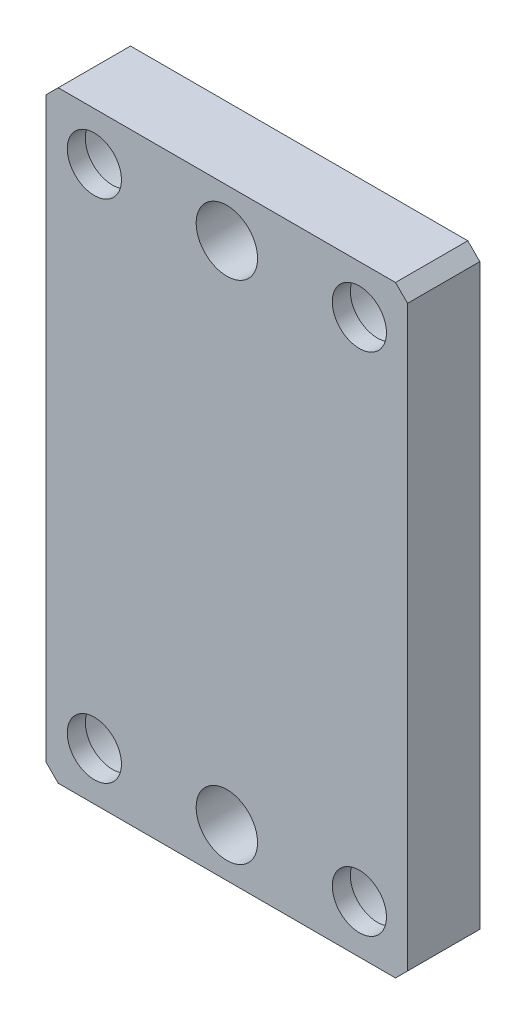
ISO-10303-21;
HEADER;
FILE_DESCRIPTION(('STEP AP214'),'2;1');
FILE_NAME('part.step','',(''),(''),'','','');
FILE_SCHEMA(('AUTOMOTIVE_DESIGN { 1 0 10303 214 1 1 1 1 }'));
ENDSEC;
DATA;
#1=APPLICATION_CONTEXT('core data for automotive mechanical design processes');
#2=APPLICATION_PROTOCOL_DEFINITION('international standard','automotive_design',2000,#1);
#3=PRODUCT_CONTEXT('',#1,'mechanical');
#4=PRODUCT('Part','Part','',(#3));
#5=PRODUCT_RELATED_PRODUCT_CATEGORY('part','',(#4));
#6=PRODUCT_DEFINITION_FORMATION('','',#4);
#7=PRODUCT_DEFINITION_CONTEXT('part definition',#1,'design');
#8=PRODUCT_DEFINITION('design','',#6,#7);
#9=PRODUCT_DEFINITION_SHAPE('','',#8);
#10=(LENGTH_UNIT() NAMED_UNIT(*) SI_UNIT(.MILLI.,.METRE.));
#11=(NAMED_UNIT(*) PLANE_ANGLE_UNIT() SI_UNIT($,.RADIAN.));
#12=(NAMED_UNIT(*) SI_UNIT($,.STERADIAN.) SOLID_ANGLE_UNIT());
#13=UNCERTAINTY_MEASURE_WITH_UNIT(LENGTH_MEASURE(1.E-05),#10,'distance_accuracy_value','');
#14=(GEOMETRIC_REPRESENTATION_CONTEXT(3) GLOBAL_UNCERTAINTY_ASSIGNED_CONTEXT((#13)) GLOBAL_UNIT_ASSIGNED_CONTEXT((#10,
#11,#12)) REPRESENTATION_CONTEXT('',''));
#15=CARTESIAN_POINT('',(0.,0.,0.));
#16=DIRECTION('',(0.,0.,1.));
#17=DIRECTION('',(1.,0.,0.));
#18=AXIS2_PLACEMENT_3D('',#15,#16,#17);
#19=CARTESIAN_POINT('',(30.,50.,12.));
#20=DIRECTION('',(-1.,0.,0.));
#21=DIRECTION('',(0.,-1.,0.));
#22=AXIS2_PLACEMENT_3D('',#19,#20,#21);
#23=PLANE('',#22);
#24=DIRECTION('',(0.,1.,0.));
#25=VECTOR('',#24,1.);
#26=CARTESIAN_POINT('',(30.,50.,0.));
#27=LINE('',#26,#25);
#28=CARTESIAN_POINT('',(30.,-48.,0.));
#29=VERTEX_POINT('',#28);
#30=CARTESIAN_POINT('',(30.,48.,0.));
#31=VERTEX_POINT('',#30);
#32=EDGE_CURVE('E140',#29,#31,#27,.T.);
#33=ORIENTED_EDGE('',*,*,#32,.T.);
#34=DIRECTION('',(0.,0.,1.));
#35=VECTOR('',#34,1.);
#36=CARTESIAN_POINT('',(30.,48.,12.));
#37=LINE('',#36,#35);
#38=CARTESIAN_POINT('',(30.,48.,12.));
#39=VERTEX_POINT('',#38);
#40=EDGE_CURVE('E11',#31,#39,#37,.T.);
#41=ORIENTED_EDGE('',*,*,#40,.T.);
#42=DIRECTION('',(0.,1.,0.));
#43=VECTOR('',#42,1.);
#44=CARTESIAN_POINT('',(30.,50.,12.));
#45=LINE('',#44,#43);
#46=CARTESIAN_POINT('',(30.,-48.,12.));
#47=VERTEX_POINT('',#46);
#48=EDGE_CURVE('E108',#47,#39,#45,.T.);
#49=ORIENTED_EDGE('',*,*,#48,.F.);
#50=DIRECTION('',(0.,0.,-1.));
#51=VECTOR('',#50,1.);
#52=CARTESIAN_POINT('',(30.,-48.,12.));
#53=LINE('',#52,#51);
#54=EDGE_CURVE('E24',#47,#29,#53,.T.);
#55=ORIENTED_EDGE('',*,*,#54,.T.);
#56=EDGE_LOOP('',(#33,#41,#49,#55));
#57=FACE_BOUND('',#56,.T.);
#58=ADVANCED_FACE('F16',(#57),#23,.F.);
#59=CARTESIAN_POINT('',(-30.,50.,12.));
#60=DIRECTION('',(0.,-1.,0.));
#61=DIRECTION('',(0.,0.,-1.));
#62=AXIS2_PLACEMENT_3D('',#59,#60,#61);
#63=PLANE('',#62);
#64=DIRECTION('',(-1.,0.,0.));
#65=VECTOR('',#64,1.);
#66=CARTESIAN_POINT('',(-30.,50.,0.));
#67=LINE('',#66,#65);
#68=CARTESIAN_POINT('',(28.,50.,0.));
#69=VERTEX_POINT('',#68);
#70=CARTESIAN_POINT('',(-28.,50.,0.));
#71=VERTEX_POINT('',#70);
#72=EDGE_CURVE('E113',#69,#71,#67,.T.);
#73=ORIENTED_EDGE('',*,*,#72,.T.);
#74=DIRECTION('',(0.,0.,1.));
#75=VECTOR('',#74,1.);
#76=CARTESIAN_POINT('',(-28.,50.,12.));
#77=LINE('',#76,#75);
#78=CARTESIAN_POINT('',(-28.,50.,12.));
#79=VERTEX_POINT('',#78);
#80=EDGE_CURVE('E31',#71,#79,#77,.T.);
#81=ORIENTED_EDGE('',*,*,#80,.T.);
#82=DIRECTION('',(-1.,0.,0.));
#83=VECTOR('',#82,1.);
#84=CARTESIAN_POINT('',(-30.,50.,12.));
#85=LINE('',#84,#83);
#86=CARTESIAN_POINT('',(28.,50.,12.));
#87=VERTEX_POINT('',#86);
#88=EDGE_CURVE('E111',#87,#79,#85,.T.);
#89=ORIENTED_EDGE('',*,*,#88,.F.);
#90=DIRECTION('',(0.,0.,-1.));
#91=VECTOR('',#90,1.);
#92=CARTESIAN_POINT('',(28.,50.,12.));
#93=LINE('',#92,#91);
#94=EDGE_CURVE('E132',#87,#69,#93,.T.);
#95=ORIENTED_EDGE('',*,*,#94,.T.);
#96=EDGE_LOOP('',(#73,#81,#89,#95));
#97=FACE_BOUND('',#96,.T.);
#98=ADVANCED_FACE('F245',(#97),#63,.F.);
#99=CARTESIAN_POINT('',(-30.,50.,12.));
#100=DIRECTION('',(1.,0.,0.));
#101=DIRECTION('',(0.,1.,0.));
#102=AXIS2_PLACEMENT_3D('',#99,#100,#101);
#103=PLANE('',#102);
#104=DIRECTION('',(0.,-1.,0.));
#105=VECTOR('',#104,1.);
#106=CARTESIAN_POINT('',(-30.,50.,0.));
#107=LINE('',#106,#105);
#108=CARTESIAN_POINT('',(-30.,48.,0.));
#109=VERTEX_POINT('',#108);
#110=CARTESIAN_POINT('',(-30.,-48.,0.));
#111=VERTEX_POINT('',#110);
#112=EDGE_CURVE('E109',#109,#111,#107,.T.);
#113=ORIENTED_EDGE('',*,*,#112,.T.);
#114=DIRECTION('',(0.,0.,1.));
#115=VECTOR('',#114,1.);
#116=CARTESIAN_POINT('',(-30.,-48.,12.));
#117=LINE('',#116,#115);
#118=CARTESIAN_POINT('',(-30.,-48.,12.));
#119=VERTEX_POINT('',#118);
#120=EDGE_CURVE('E87',#111,#119,#117,.T.);
#121=ORIENTED_EDGE('',*,*,#120,.T.);
#122=DIRECTION('',(0.,-1.,0.));
#123=VECTOR('',#122,1.);
#124=CARTESIAN_POINT('',(-30.,50.,12.));
#125=LINE('',#124,#123);
#126=CARTESIAN_POINT('',(-30.,48.,12.));
#127=VERTEX_POINT('',#126);
#128=EDGE_CURVE('E152',#127,#119,#125,.T.);
#129=ORIENTED_EDGE('',*,*,#128,.F.);
#130=DIRECTION('',(0.,0.,-1.));
#131=VECTOR('',#130,1.);
#132=CARTESIAN_POINT('',(-30.,48.,12.));
#133=LINE('',#132,#131);
#134=EDGE_CURVE('E92',#127,#109,#133,.T.);
#135=ORIENTED_EDGE('',*,*,#134,.T.);
#136=EDGE_LOOP('',(#113,#121,#129,#135));
#137=FACE_BOUND('',#136,.T.);
#138=ADVANCED_FACE('F251',(#137),#103,.F.);
#139=CARTESIAN_POINT('',(-30.,-50.,12.));
#140=DIRECTION('',(0.,1.,0.));
#141=DIRECTION('',(0.,0.,1.));
#142=AXIS2_PLACEMENT_3D('',#139,#140,#141);
#143=PLANE('',#142);
#144=DIRECTION('',(1.,0.,0.));
#145=VECTOR('',#144,1.);
#146=CARTESIAN_POINT('',(-30.,-50.,12.));
#147=LINE('',#146,#145);
#148=CARTESIAN_POINT('',(-28.,-50.,12.));
#149=VERTEX_POINT('',#148);
#150=CARTESIAN_POINT('',(28.,-50.,12.));
#151=VERTEX_POINT('',#150);
#152=EDGE_CURVE('E102',#149,#151,#147,.T.);
#153=ORIENTED_EDGE('',*,*,#152,.F.);
#154=DIRECTION('',(0.,0.,-1.));
#155=VECTOR('',#154,1.);
#156=CARTESIAN_POINT('',(-28.,-50.,12.));
#157=LINE('',#156,#155);
#158=CARTESIAN_POINT('',(-28.,-50.,0.));
#159=VERTEX_POINT('',#158);
#160=EDGE_CURVE('E86',#149,#159,#157,.T.);
#161=ORIENTED_EDGE('',*,*,#160,.T.);
#162=DIRECTION('',(1.,0.,0.));
#163=VECTOR('',#162,1.);
#164=CARTESIAN_POINT('',(-30.,-50.,0.));
#165=LINE('',#164,#163);
#166=CARTESIAN_POINT('',(28.,-50.,0.));
#167=VERTEX_POINT('',#166);
#168=EDGE_CURVE('E99',#159,#167,#165,.T.);
#169=ORIENTED_EDGE('',*,*,#168,.T.);
#170=DIRECTION('',(0.,0.,1.));
#171=VECTOR('',#170,1.);
#172=CARTESIAN_POINT('',(28.,-50.,12.));
#173=LINE('',#172,#171);
#174=EDGE_CURVE('E104',#167,#151,#173,.T.);
#175=ORIENTED_EDGE('',*,*,#174,.T.);
#176=EDGE_LOOP('',(#153,#161,#169,#175));
#177=FACE_BOUND('',#176,.T.);
#178=ADVANCED_FACE('F98',(#177),#143,.F.);
#179=CARTESIAN_POINT('',(0.,0.,12.));
#180=DIRECTION('',(0.,0.,1.));
#181=DIRECTION('',(1.,0.,0.));
#182=AXIS2_PLACEMENT_3D('',#179,#180,#181);
#183=PLANE('',#182);
#184=CARTESIAN_POINT('',(-22.,-42.,12.));
#185=DIRECTION('',(0.,0.,-1.));
#186=DIRECTION('',(-1.,0.,0.));
#187=AXIS2_PLACEMENT_3D('',#184,#185,#186);
#188=CIRCLE('',#187,4.5);
#189=CARTESIAN_POINT('',(-26.5,-42.,12.));
#190=VERTEX_POINT('',#189);
#191=EDGE_CURVE('E200',#190,#190,#188,.T.);
#192=ORIENTED_EDGE('',*,*,#191,.T.);
#193=EDGE_LOOP('',(#192));
#194=FACE_BOUND('',#193,.T.);
#195=CARTESIAN_POINT('',(22.,-42.,12.));
#196=DIRECTION('',(0.,0.,-1.));
#197=DIRECTION('',(-1.,0.,0.));
#198=AXIS2_PLACEMENT_3D('',#195,#196,#197);
#199=CIRCLE('',#198,4.5);
#200=CARTESIAN_POINT('',(17.5,-42.,12.));
#201=VERTEX_POINT('',#200);
#202=EDGE_CURVE('E188',#201,#201,#199,.T.);
#203=ORIENTED_EDGE('',*,*,#202,.T.);
#204=EDGE_LOOP('',(#203));
#205=FACE_BOUND('',#204,.T.);
#206=CARTESIAN_POINT('',(-22.,42.,12.));
#207=DIRECTION('',(0.,0.,-1.));
#208=DIRECTION('',(-1.,0.,0.));
#209=AXIS2_PLACEMENT_3D('',#206,#207,#208);
#210=CIRCLE('',#209,4.5);
#211=CARTESIAN_POINT('',(-26.5,42.,12.));
#212=VERTEX_POINT('',#211);
#213=EDGE_CURVE('E176',#212,#212,#210,.T.);
#214=ORIENTED_EDGE('',*,*,#213,.T.);
#215=EDGE_LOOP('',(#214));
#216=FACE_BOUND('',#215,.T.);
#217=CARTESIAN_POINT('',(22.,42.,12.));
#218=DIRECTION('',(0.,0.,-1.));
#219=DIRECTION('',(-1.,0.,0.));
#220=AXIS2_PLACEMENT_3D('',#217,#218,#219);
#221=CIRCLE('',#220,4.5);
#222=CARTESIAN_POINT('',(17.5,42.,12.));
#223=VERTEX_POINT('',#222);
#224=EDGE_CURVE('E164',#223,#223,#221,.T.);
#225=ORIENTED_EDGE('',*,*,#224,.T.);
#226=EDGE_LOOP('',(#225));
#227=FACE_BOUND('',#226,.T.);
#228=CARTESIAN_POINT('',(0.,-42.,12.));
#229=DIRECTION('',(0.,0.,-1.));
#230=DIRECTION('',(-1.,0.,0.));
#231=AXIS2_PLACEMENT_3D('',#228,#229,#230);
#232=CIRCLE('',#231,5.1);
#233=CARTESIAN_POINT('',(-5.10000000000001,-42.,12.));
#234=VERTEX_POINT('',#233);
#235=EDGE_CURVE('E158',#234,#234,#232,.T.);
#236=ORIENTED_EDGE('',*,*,#235,.T.);
#237=EDGE_LOOP('',(#236));
#238=FACE_BOUND('',#237,.T.);
#239=CARTESIAN_POINT('',(0.,42.,12.));
#240=DIRECTION('',(0.,0.,-1.));
#241=DIRECTION('',(-1.,0.,0.));
#242=AXIS2_PLACEMENT_3D('',#239,#240,#241);
#243=CIRCLE('',#242,5.1);
#244=CARTESIAN_POINT('',(-5.1,42.,12.));
#245=VERTEX_POINT('',#244);
#246=EDGE_CURVE('E145',#245,#245,#243,.T.);
#247=ORIENTED_EDGE('',*,*,#246,.T.);
#248=EDGE_LOOP('',(#247));
#249=FACE_BOUND('',#248,.T.);
#250=ORIENTED_EDGE('',*,*,#128,.T.);
#251=DIRECTION('',(-0.707106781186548,0.707106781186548,0.));
#252=VECTOR('',#251,1.);
#253=CARTESIAN_POINT('',(-39.,-39.,12.));
#254=LINE('',#253,#252);
#255=EDGE_CURVE('E130',#119,#149,#254,.F.);
#256=ORIENTED_EDGE('',*,*,#255,.T.);
#257=ORIENTED_EDGE('',*,*,#152,.T.);
#258=DIRECTION('',(-0.707106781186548,-0.707106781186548,0.));
#259=VECTOR('',#258,1.);
#260=CARTESIAN_POINT('',(39.,-39.,12.));
#261=LINE('',#260,#259);
#262=EDGE_CURVE('E125',#151,#47,#261,.F.);
#263=ORIENTED_EDGE('',*,*,#262,.T.);
#264=ORIENTED_EDGE('',*,*,#48,.T.);
#265=DIRECTION('',(0.707106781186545,-0.707106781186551,0.));
#266=VECTOR('',#265,1.);
#267=CARTESIAN_POINT('',(39.,39.,12.));
#268=LINE('',#267,#266);
#269=EDGE_CURVE('E38',#39,#87,#268,.F.);
#270=ORIENTED_EDGE('',*,*,#269,.T.);
#271=ORIENTED_EDGE('',*,*,#88,.T.);
#272=DIRECTION('',(0.707106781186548,0.707106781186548,0.));
#273=VECTOR('',#272,1.);
#274=CARTESIAN_POINT('',(-39.,39.,12.));
#275=LINE('',#274,#273);
#276=EDGE_CURVE('E128',#79,#127,#275,.F.);
#277=ORIENTED_EDGE('',*,*,#276,.T.);
#278=EDGE_LOOP('',(#250,#256,#257,#263,#264,#270,#271,#277));
#279=FACE_BOUND('',#278,.T.);
#280=ADVANCED_FACE('F218',(#194,#205,#216,#227,#238,#249,#279),#183,.T.);
#281=CARTESIAN_POINT('',(0.,0.,0.));
#282=DIRECTION('',(0.,0.,1.));
#283=DIRECTION('',(1.,0.,0.));
#284=AXIS2_PLACEMENT_3D('',#281,#282,#283);
#285=PLANE('',#284);
#286=CARTESIAN_POINT('',(-22.,-42.,0.));
#287=DIRECTION('',(0.,0.,-1.));
#288=DIRECTION('',(-1.,0.,0.));
#289=AXIS2_PLACEMENT_3D('',#286,#287,#288);
#290=CIRCLE('',#289,7.5);
#291=CARTESIAN_POINT('',(-29.5,-42.,0.));
#292=VERTEX_POINT('',#291);
#293=EDGE_CURVE('E209',#292,#292,#290,.T.);
#294=ORIENTED_EDGE('',*,*,#293,.F.);
#295=EDGE_LOOP('',(#294));
#296=FACE_BOUND('',#295,.T.);
#297=CARTESIAN_POINT('',(22.,-42.,0.));
#298=DIRECTION('',(0.,0.,-1.));
#299=DIRECTION('',(-1.,0.,0.));
#300=AXIS2_PLACEMENT_3D('',#297,#298,#299);
#301=CIRCLE('',#300,7.5);
#302=CARTESIAN_POINT('',(14.5,-42.,0.));
#303=VERTEX_POINT('',#302);
#304=EDGE_CURVE('E197',#303,#303,#301,.T.);
#305=ORIENTED_EDGE('',*,*,#304,.F.);
#306=EDGE_LOOP('',(#305));
#307=FACE_BOUND('',#306,.T.);
#308=CARTESIAN_POINT('',(-22.,42.,0.));
#309=DIRECTION('',(0.,0.,-1.));
#310=DIRECTION('',(-1.,0.,0.));
#311=AXIS2_PLACEMENT_3D('',#308,#309,#310);
#312=CIRCLE('',#311,7.5);
#313=CARTESIAN_POINT('',(-29.5,42.,0.));
#314=VERTEX_POINT('',#313);
#315=EDGE_CURVE('E185',#314,#314,#312,.T.);
#316=ORIENTED_EDGE('',*,*,#315,.F.);
#317=EDGE_LOOP('',(#316));
#318=FACE_BOUND('',#317,.T.);
#319=CARTESIAN_POINT('',(22.,42.,0.));
#320=DIRECTION('',(0.,0.,-1.));
#321=DIRECTION('',(-1.,0.,0.));
#322=AXIS2_PLACEMENT_3D('',#319,#320,#321);
#323=CIRCLE('',#322,7.5);
#324=CARTESIAN_POINT('',(14.5,42.,0.));
#325=VERTEX_POINT('',#324);
#326=EDGE_CURVE('E173',#325,#325,#323,.T.);
#327=ORIENTED_EDGE('',*,*,#326,.F.);
#328=EDGE_LOOP('',(#327));
#329=FACE_BOUND('',#328,.T.);
#330=CARTESIAN_POINT('',(0.,-42.,0.));
#331=DIRECTION('',(0.,0.,-1.));
#332=DIRECTION('',(-1.,0.,0.));
#333=AXIS2_PLACEMENT_3D('',#330,#331,#332);
#334=CIRCLE('',#333,5.1);
#335=CARTESIAN_POINT('',(-5.10000000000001,-42.,0.));
#336=VERTEX_POINT('',#335);
#337=EDGE_CURVE('E161',#336,#336,#334,.T.);
#338=ORIENTED_EDGE('',*,*,#337,.F.);
#339=EDGE_LOOP('',(#338));
#340=FACE_BOUND('',#339,.T.);
#341=CARTESIAN_POINT('',(0.,42.,0.));
#342=DIRECTION('',(0.,0.,-1.));
#343=DIRECTION('',(-1.,0.,0.));
#344=AXIS2_PLACEMENT_3D('',#341,#342,#343);
#345=CIRCLE('',#344,5.1);
#346=CARTESIAN_POINT('',(-5.1,42.,0.));
#347=VERTEX_POINT('',#346);
#348=EDGE_CURVE('E148',#347,#347,#345,.T.);
#349=ORIENTED_EDGE('',*,*,#348,.F.);
#350=EDGE_LOOP('',(#349));
#351=FACE_BOUND('',#350,.T.);
#352=ORIENTED_EDGE('',*,*,#168,.F.);
#353=DIRECTION('',(0.707106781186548,-0.707106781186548,0.));
#354=VECTOR('',#353,1.);
#355=CARTESIAN_POINT('',(-28.,-50.,0.));
#356=LINE('',#355,#354);
#357=EDGE_CURVE('E82',#159,#111,#356,.F.);
#358=ORIENTED_EDGE('',*,*,#357,.T.);
#359=ORIENTED_EDGE('',*,*,#112,.F.);
#360=DIRECTION('',(-0.707106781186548,-0.707106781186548,0.));
#361=VECTOR('',#360,1.);
#362=CARTESIAN_POINT('',(-30.,48.,0.));
#363=LINE('',#362,#361);
#364=EDGE_CURVE('E93',#109,#71,#363,.F.);
#365=ORIENTED_EDGE('',*,*,#364,.T.);
#366=ORIENTED_EDGE('',*,*,#72,.F.);
#367=DIRECTION('',(-0.707106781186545,0.707106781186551,0.));
#368=VECTOR('',#367,1.);
#369=CARTESIAN_POINT('',(28.,50.,0.));
#370=LINE('',#369,#368);
#371=EDGE_CURVE('E119',#69,#31,#370,.F.);
#372=ORIENTED_EDGE('',*,*,#371,.T.);
#373=ORIENTED_EDGE('',*,*,#32,.F.);
#374=DIRECTION('',(0.707106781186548,0.707106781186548,0.));
#375=VECTOR('',#374,1.);
#376=CARTESIAN_POINT('',(30.,-48.,0.));
#377=LINE('',#376,#375);
#378=EDGE_CURVE('E103',#29,#167,#377,.F.);
#379=ORIENTED_EDGE('',*,*,#378,.T.);
#380=EDGE_LOOP('',(#352,#358,#359,#365,#366,#372,#373,#379));
#381=FACE_BOUND('',#380,.T.);
#382=ADVANCED_FACE('F106',(#296,#307,#318,#329,#340,#351,#381),#285,.F.);
#383=CARTESIAN_POINT('',(0.,42.,0.));
#384=DIRECTION('',(0.,0.,-1.));
#385=DIRECTION('',(-1.,0.,0.));
#386=AXIS2_PLACEMENT_3D('',#383,#384,#385);
#387=CYLINDRICAL_SURFACE('',#386,5.1);
#388=ORIENTED_EDGE('',*,*,#246,.F.);
#389=EDGE_LOOP('',(#388));
#390=FACE_BOUND('',#389,.T.);
#391=ORIENTED_EDGE('',*,*,#348,.T.);
#392=EDGE_LOOP('',(#391));
#393=FACE_BOUND('',#392,.T.);
#394=ADVANCED_FACE('F217',(#390,#393),#387,.F.);
#395=CARTESIAN_POINT('',(0.,-42.,0.));
#396=DIRECTION('',(0.,0.,-1.));
#397=DIRECTION('',(-1.,0.,0.));
#398=AXIS2_PLACEMENT_3D('',#395,#396,#397);
#399=CYLINDRICAL_SURFACE('',#398,5.1);
#400=ORIENTED_EDGE('',*,*,#235,.F.);
#401=EDGE_LOOP('',(#400));
#402=FACE_BOUND('',#401,.T.);
#403=ORIENTED_EDGE('',*,*,#337,.T.);
#404=EDGE_LOOP('',(#403));
#405=FACE_BOUND('',#404,.T.);
#406=ADVANCED_FACE('F231',(#402,#405),#399,.F.);
#407=CARTESIAN_POINT('',(22.,42.,0.));
#408=DIRECTION('',(0.,0.,-1.));
#409=DIRECTION('',(-1.,0.,0.));
#410=AXIS2_PLACEMENT_3D('',#407,#408,#409);
#411=CYLINDRICAL_SURFACE('',#410,4.5);
#412=ORIENTED_EDGE('',*,*,#224,.F.);
#413=EDGE_LOOP('',(#412));
#414=FACE_BOUND('',#413,.T.);
#415=CARTESIAN_POINT('',(22.,42.,9.));
#416=DIRECTION('',(0.,0.,-1.));
#417=DIRECTION('',(-1.,0.,0.));
#418=AXIS2_PLACEMENT_3D('',#415,#416,#417);
#419=CIRCLE('',#418,4.5);
#420=CARTESIAN_POINT('',(17.5,42.,9.));
#421=VERTEX_POINT('',#420);
#422=EDGE_CURVE('E167',#421,#421,#419,.T.);
#423=ORIENTED_EDGE('',*,*,#422,.T.);
#424=EDGE_LOOP('',(#423));
#425=FACE_BOUND('',#424,.T.);
#426=ADVANCED_FACE('F239',(#414,#425),#411,.F.);
#427=CARTESIAN_POINT('',(26.5,42.,9.));
#428=DIRECTION('',(0.,0.,1.));
#429=DIRECTION('',(1.,0.,0.));
#430=AXIS2_PLACEMENT_3D('',#427,#428,#429);
#431=PLANE('',#430);
#432=ORIENTED_EDGE('',*,*,#422,.F.);
#433=EDGE_LOOP('',(#432));
#434=FACE_BOUND('',#433,.T.);
#435=CARTESIAN_POINT('',(22.,42.,9.));
#436=DIRECTION('',(0.,0.,-1.));
#437=DIRECTION('',(-1.,0.,0.));
#438=AXIS2_PLACEMENT_3D('',#435,#436,#437);
#439=CIRCLE('',#438,7.5);
#440=CARTESIAN_POINT('',(14.5,42.,9.));
#441=VERTEX_POINT('',#440);
#442=EDGE_CURVE('E170',#441,#441,#439,.T.);
#443=ORIENTED_EDGE('',*,*,#442,.T.);
#444=EDGE_LOOP('',(#443));
#445=FACE_BOUND('',#444,.T.);
#446=ADVANCED_FACE('F325',(#434,#445),#431,.F.);
#447=CARTESIAN_POINT('',(22.,42.,0.));
#448=DIRECTION('',(0.,0.,-1.));
#449=DIRECTION('',(-1.,0.,0.));
#450=AXIS2_PLACEMENT_3D('',#447,#448,#449);
#451=CYLINDRICAL_SURFACE('',#450,7.5);
#452=ORIENTED_EDGE('',*,*,#442,.F.);
#453=EDGE_LOOP('',(#452));
#454=FACE_BOUND('',#453,.T.);
#455=ORIENTED_EDGE('',*,*,#326,.T.);
#456=EDGE_LOOP('',(#455));
#457=FACE_BOUND('',#456,.T.);
#458=ADVANCED_FACE('F335',(#454,#457),#451,.F.);
#459=CARTESIAN_POINT('',(-22.,42.,0.));
#460=DIRECTION('',(0.,0.,-1.));
#461=DIRECTION('',(-1.,0.,0.));
#462=AXIS2_PLACEMENT_3D('',#459,#460,#461);
#463=CYLINDRICAL_SURFACE('',#462,4.5);
#464=ORIENTED_EDGE('',*,*,#213,.F.);
#465=EDGE_LOOP('',(#464));
#466=FACE_BOUND('',#465,.T.);
#467=CARTESIAN_POINT('',(-22.,42.,9.));
#468=DIRECTION('',(0.,0.,-1.));
#469=DIRECTION('',(-1.,0.,0.));
#470=AXIS2_PLACEMENT_3D('',#467,#468,#469);
#471=CIRCLE('',#470,4.5);
#472=CARTESIAN_POINT('',(-26.5,42.,9.));
#473=VERTEX_POINT('',#472);
#474=EDGE_CURVE('E179',#473,#473,#471,.T.);
#475=ORIENTED_EDGE('',*,*,#474,.T.);
#476=EDGE_LOOP('',(#475));
#477=FACE_BOUND('',#476,.T.);
#478=ADVANCED_FACE('F345',(#466,#477),#463,.F.);
#479=CARTESIAN_POINT('',(-17.5,42.,9.));
#480=DIRECTION('',(0.,0.,1.));
#481=DIRECTION('',(1.,0.,0.));
#482=AXIS2_PLACEMENT_3D('',#479,#480,#481);
#483=PLANE('',#482);
#484=ORIENTED_EDGE('',*,*,#474,.F.);
#485=EDGE_LOOP('',(#484));
#486=FACE_BOUND('',#485,.T.);
#487=CARTESIAN_POINT('',(-22.,42.,9.));
#488=DIRECTION('',(0.,0.,-1.));
#489=DIRECTION('',(-1.,0.,0.));
#490=AXIS2_PLACEMENT_3D('',#487,#488,#489);
#491=CIRCLE('',#490,7.5);
#492=CARTESIAN_POINT('',(-29.5,42.,9.));
#493=VERTEX_POINT('',#492);
#494=EDGE_CURVE('E182',#493,#493,#491,.T.);
#495=ORIENTED_EDGE('',*,*,#494,.T.);
#496=EDGE_LOOP('',(#495));
#497=FACE_BOUND('',#496,.T.);
#498=ADVANCED_FACE('F355',(#486,#497),#483,.F.);
#499=CARTESIAN_POINT('',(-22.,42.,0.));
#500=DIRECTION('',(0.,0.,-1.));
#501=DIRECTION('',(-1.,0.,0.));
#502=AXIS2_PLACEMENT_3D('',#499,#500,#501);
#503=CYLINDRICAL_SURFACE('',#502,7.5);
#504=ORIENTED_EDGE('',*,*,#494,.F.);
#505=EDGE_LOOP('',(#504));
#506=FACE_BOUND('',#505,.T.);
#507=ORIENTED_EDGE('',*,*,#315,.T.);
#508=EDGE_LOOP('',(#507));
#509=FACE_BOUND('',#508,.T.);
#510=ADVANCED_FACE('F365',(#506,#509),#503,.F.);
#511=CARTESIAN_POINT('',(22.,-42.,0.));
#512=DIRECTION('',(0.,0.,-1.));
#513=DIRECTION('',(-1.,0.,0.));
#514=AXIS2_PLACEMENT_3D('',#511,#512,#513);
#515=CYLINDRICAL_SURFACE('',#514,4.5);
#516=ORIENTED_EDGE('',*,*,#202,.F.);
#517=EDGE_LOOP('',(#516));
#518=FACE_BOUND('',#517,.T.);
#519=CARTESIAN_POINT('',(22.,-42.,9.));
#520=DIRECTION('',(0.,0.,-1.));
#521=DIRECTION('',(-1.,0.,0.));
#522=AXIS2_PLACEMENT_3D('',#519,#520,#521);
#523=CIRCLE('',#522,4.5);
#524=CARTESIAN_POINT('',(17.5,-42.,9.));
#525=VERTEX_POINT('',#524);
#526=EDGE_CURVE('E191',#525,#525,#523,.T.);
#527=ORIENTED_EDGE('',*,*,#526,.T.);
#528=EDGE_LOOP('',(#527));
#529=FACE_BOUND('',#528,.T.);
#530=ADVANCED_FACE('F375',(#518,#529),#515,.F.);
#531=CARTESIAN_POINT('',(26.5,-42.,9.));
#532=DIRECTION('',(0.,0.,1.));
#533=DIRECTION('',(1.,0.,0.));
#534=AXIS2_PLACEMENT_3D('',#531,#532,#533);
#535=PLANE('',#534);
#536=ORIENTED_EDGE('',*,*,#526,.F.);
#537=EDGE_LOOP('',(#536));
#538=FACE_BOUND('',#537,.T.);
#539=CARTESIAN_POINT('',(22.,-42.,9.));
#540=DIRECTION('',(0.,0.,-1.));
#541=DIRECTION('',(-1.,0.,0.));
#542=AXIS2_PLACEMENT_3D('',#539,#540,#541);
#543=CIRCLE('',#542,7.5);
#544=CARTESIAN_POINT('',(14.5,-42.,9.));
#545=VERTEX_POINT('',#544);
#546=EDGE_CURVE('E194',#545,#545,#543,.T.);
#547=ORIENTED_EDGE('',*,*,#546,.T.);
#548=EDGE_LOOP('',(#547));
#549=FACE_BOUND('',#548,.T.);
#550=ADVANCED_FACE('F385',(#538,#549),#535,.F.);
#551=CARTESIAN_POINT('',(22.,-42.,0.));
#552=DIRECTION('',(0.,0.,-1.));
#553=DIRECTION('',(-1.,0.,0.));
#554=AXIS2_PLACEMENT_3D('',#551,#552,#553);
#555=CYLINDRICAL_SURFACE('',#554,7.5);
#556=ORIENTED_EDGE('',*,*,#546,.F.);
#557=EDGE_LOOP('',(#556));
#558=FACE_BOUND('',#557,.T.);
#559=ORIENTED_EDGE('',*,*,#304,.T.);
#560=EDGE_LOOP('',(#559));
#561=FACE_BOUND('',#560,.T.);
#562=ADVANCED_FACE('F395',(#558,#561),#555,.F.);
#563=CARTESIAN_POINT('',(-22.,-42.,0.));
#564=DIRECTION('',(0.,0.,-1.));
#565=DIRECTION('',(-1.,0.,0.));
#566=AXIS2_PLACEMENT_3D('',#563,#564,#565);
#567=CYLINDRICAL_SURFACE('',#566,4.5);
#568=ORIENTED_EDGE('',*,*,#191,.F.);
#569=EDGE_LOOP('',(#568));
#570=FACE_BOUND('',#569,.T.);
#571=CARTESIAN_POINT('',(-22.,-42.,9.));
#572=DIRECTION('',(0.,0.,-1.));
#573=DIRECTION('',(-1.,0.,0.));
#574=AXIS2_PLACEMENT_3D('',#571,#572,#573);
#575=CIRCLE('',#574,4.5);
#576=CARTESIAN_POINT('',(-26.5,-42.,9.));
#577=VERTEX_POINT('',#576);
#578=EDGE_CURVE('E203',#577,#577,#575,.T.);
#579=ORIENTED_EDGE('',*,*,#578,.T.);
#580=EDGE_LOOP('',(#579));
#581=FACE_BOUND('',#580,.T.);
#582=ADVANCED_FACE('F405',(#570,#581),#567,.F.);
#583=CARTESIAN_POINT('',(-17.5,-42.,9.));
#584=DIRECTION('',(0.,0.,1.));
#585=DIRECTION('',(1.,0.,0.));
#586=AXIS2_PLACEMENT_3D('',#583,#584,#585);
#587=PLANE('',#586);
#588=ORIENTED_EDGE('',*,*,#578,.F.);
#589=EDGE_LOOP('',(#588));
#590=FACE_BOUND('',#589,.T.);
#591=CARTESIAN_POINT('',(-22.,-42.,9.));
#592=DIRECTION('',(0.,0.,-1.));
#593=DIRECTION('',(-1.,0.,0.));
#594=AXIS2_PLACEMENT_3D('',#591,#592,#593);
#595=CIRCLE('',#594,7.5);
#596=CARTESIAN_POINT('',(-29.5,-42.,9.));
#597=VERTEX_POINT('',#596);
#598=EDGE_CURVE('E206',#597,#597,#595,.T.);
#599=ORIENTED_EDGE('',*,*,#598,.T.);
#600=EDGE_LOOP('',(#599));
#601=FACE_BOUND('',#600,.T.);
#602=ADVANCED_FACE('F415',(#590,#601),#587,.F.);
#603=CARTESIAN_POINT('',(-22.,-42.,0.));
#604=DIRECTION('',(0.,0.,-1.));
#605=DIRECTION('',(-1.,0.,0.));
#606=AXIS2_PLACEMENT_3D('',#603,#604,#605);
#607=CYLINDRICAL_SURFACE('',#606,7.5);
#608=ORIENTED_EDGE('',*,*,#598,.F.);
#609=EDGE_LOOP('',(#608));
#610=FACE_BOUND('',#609,.T.);
#611=ORIENTED_EDGE('',*,*,#293,.T.);
#612=EDGE_LOOP('',(#611));
#613=FACE_BOUND('',#612,.T.);
#614=ADVANCED_FACE('F213',(#610,#613),#607,.F.);
#615=CARTESIAN_POINT('',(-28.,-50.,12.));
#616=DIRECTION('',(0.707106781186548,0.707106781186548,0.));
#617=DIRECTION('',(0.,0.,-1.));
#618=AXIS2_PLACEMENT_3D('',#615,#616,#617);
#619=PLANE('',#618);
#620=ORIENTED_EDGE('',*,*,#255,.F.);
#621=ORIENTED_EDGE('',*,*,#120,.F.);
#622=ORIENTED_EDGE('',*,*,#357,.F.);
#623=ORIENTED_EDGE('',*,*,#160,.F.);
#624=EDGE_LOOP('',(#620,#621,#622,#623));
#625=FACE_BOUND('',#624,.T.);
#626=ADVANCED_FACE('F85',(#625),#619,.F.);
#627=CARTESIAN_POINT('',(-30.,48.,12.));
#628=DIRECTION('',(0.707106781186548,-0.707106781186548,0.));
#629=DIRECTION('',(0.,0.,-1.));
#630=AXIS2_PLACEMENT_3D('',#627,#628,#629);
#631=PLANE('',#630);
#632=ORIENTED_EDGE('',*,*,#276,.F.);
#633=ORIENTED_EDGE('',*,*,#80,.F.);
#634=ORIENTED_EDGE('',*,*,#364,.F.);
#635=ORIENTED_EDGE('',*,*,#134,.F.);
#636=EDGE_LOOP('',(#632,#633,#634,#635));
#637=FACE_BOUND('',#636,.T.);
#638=ADVANCED_FACE('F257',(#637),#631,.F.);
#639=CARTESIAN_POINT('',(28.,50.,12.));
#640=DIRECTION('',(-0.707106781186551,-0.707106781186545,0.));
#641=DIRECTION('',(0.,0.,-1.));
#642=AXIS2_PLACEMENT_3D('',#639,#640,#641);
#643=PLANE('',#642);
#644=ORIENTED_EDGE('',*,*,#269,.F.);
#645=ORIENTED_EDGE('',*,*,#40,.F.);
#646=ORIENTED_EDGE('',*,*,#371,.F.);
#647=ORIENTED_EDGE('',*,*,#94,.F.);
#648=EDGE_LOOP('',(#644,#645,#646,#647));
#649=FACE_BOUND('',#648,.T.);
#650=ADVANCED_FACE('F259',(#649),#643,.F.);
#651=CARTESIAN_POINT('',(30.,-48.,12.));
#652=DIRECTION('',(-0.707106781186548,0.707106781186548,0.));
#653=DIRECTION('',(0.,0.,-1.));
#654=AXIS2_PLACEMENT_3D('',#651,#652,#653);
#655=PLANE('',#654);
#656=ORIENTED_EDGE('',*,*,#262,.F.);
#657=ORIENTED_EDGE('',*,*,#174,.F.);
#658=ORIENTED_EDGE('',*,*,#378,.F.);
#659=ORIENTED_EDGE('',*,*,#54,.F.);
#660=EDGE_LOOP('',(#656,#657,#658,#659));
#661=FACE_BOUND('',#660,.T.);
#662=ADVANCED_FACE('F18',(#661),#655,.F.);
#663=CLOSED_SHELL('',(#58,#98,#138,#178,#280,#382,#394,#406,#426,#446,#458,#478,#498,#510,#530,
#550,#562,#582,#602,#614,#626,#638,#650,#662));
#664=MANIFOLD_SOLID_BREP('B1',#663);
#665=ADVANCED_BREP_SHAPE_REPRESENTATION('',(#18,#664),#14);
#666=SHAPE_DEFINITION_REPRESENTATION(#9,#665);
ENDSEC;
END-ISO-10303-21;
